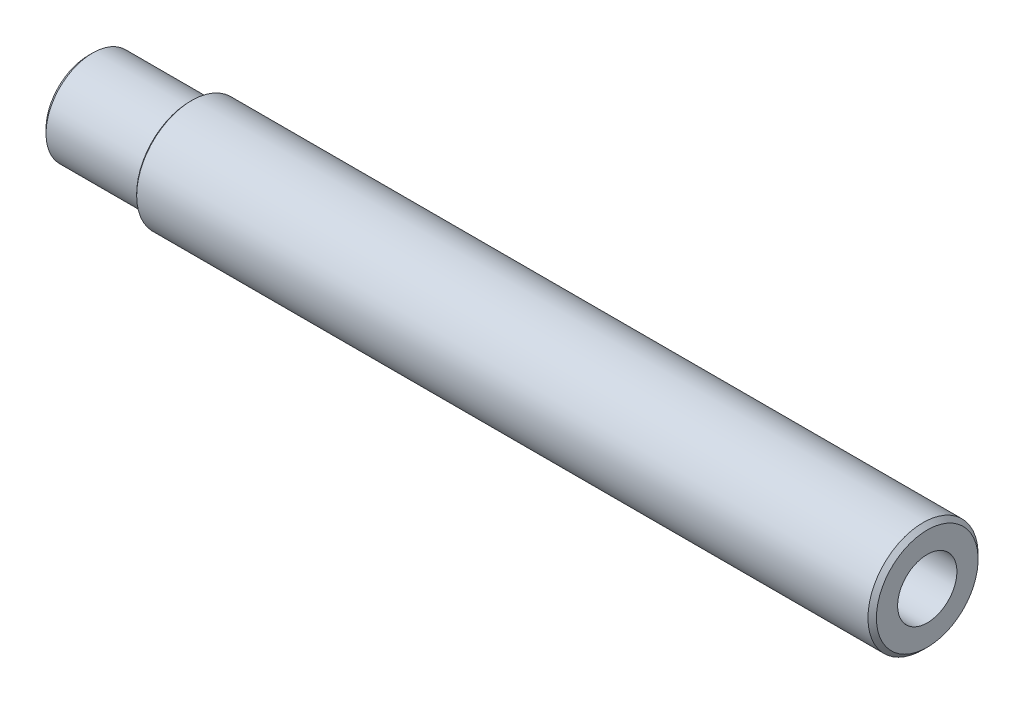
ISO-10303-21;
HEADER;
FILE_DESCRIPTION(('STEP AP214'),'2;1');
FILE_NAME('part.step','',(''),(''),'','','');
FILE_SCHEMA(('AUTOMOTIVE_DESIGN { 1 0 10303 214 1 1 1 1 }'));
ENDSEC;
DATA;
#1=APPLICATION_CONTEXT('core data for automotive mechanical design processes');
#2=APPLICATION_PROTOCOL_DEFINITION('international standard','automotive_design',2000,#1);
#3=PRODUCT_CONTEXT('',#1,'mechanical');
#4=PRODUCT('Part','Part','',(#3));
#5=PRODUCT_RELATED_PRODUCT_CATEGORY('part','',(#4));
#6=PRODUCT_DEFINITION_FORMATION('','',#4);
#7=PRODUCT_DEFINITION_CONTEXT('part definition',#1,'design');
#8=PRODUCT_DEFINITION('design','',#6,#7);
#9=PRODUCT_DEFINITION_SHAPE('','',#8);
#10=(LENGTH_UNIT() NAMED_UNIT(*) SI_UNIT(.MILLI.,.METRE.));
#11=(NAMED_UNIT(*) PLANE_ANGLE_UNIT() SI_UNIT($,.RADIAN.));
#12=(NAMED_UNIT(*) SI_UNIT($,.STERADIAN.) SOLID_ANGLE_UNIT());
#13=UNCERTAINTY_MEASURE_WITH_UNIT(LENGTH_MEASURE(1.E-05),#10,'distance_accuracy_value','');
#14=(GEOMETRIC_REPRESENTATION_CONTEXT(3) GLOBAL_UNCERTAINTY_ASSIGNED_CONTEXT((#13)) GLOBAL_UNIT_ASSIGNED_CONTEXT((#10,
#11,#12)) REPRESENTATION_CONTEXT('',''));
#15=CARTESIAN_POINT('',(0.,0.,0.));
#16=DIRECTION('',(0.,0.,1.));
#17=DIRECTION('',(1.,0.,0.));
#18=AXIS2_PLACEMENT_3D('',#15,#16,#17);
#19=CARTESIAN_POINT('',(87.,6.,0.));
#20=DIRECTION('',(-1.,0.,0.));
#21=DIRECTION('',(0.,0.,1.));
#22=AXIS2_PLACEMENT_3D('',#19,#20,#21);
#23=PLANE('',#22);
#24=CARTESIAN_POINT('',(87.,0.,0.));
#25=DIRECTION('',(-1.,0.,0.));
#26=DIRECTION('',(0.,0.,1.));
#27=AXIS2_PLACEMENT_3D('',#24,#25,#26);
#28=CIRCLE('',#27,6.);
#29=CARTESIAN_POINT('',(87.,0.,6.));
#30=VERTEX_POINT('',#29);
#31=EDGE_CURVE('E10',#30,#30,#28,.T.);
#32=ORIENTED_EDGE('',*,*,#31,.F.);
#33=EDGE_LOOP('',(#32));
#34=FACE_BOUND('',#33,.T.);
#35=CARTESIAN_POINT('',(87.,0.,0.));
#36=DIRECTION('',(-1.,0.,0.));
#37=DIRECTION('',(0.,0.,1.));
#38=AXIS2_PLACEMENT_3D('',#35,#36,#37);
#39=CIRCLE('',#38,3.5);
#40=CARTESIAN_POINT('',(87.,0.,3.5));
#41=VERTEX_POINT('',#40);
#42=EDGE_CURVE('E83',#41,#41,#39,.T.);
#43=ORIENTED_EDGE('',*,*,#42,.T.);
#44=EDGE_LOOP('',(#43));
#45=FACE_BOUND('',#44,.T.);
#46=ADVANCED_FACE('F39',(#34,#45),#23,.F.);
#47=CARTESIAN_POINT('',(-12.,0.,0.));
#48=DIRECTION('',(1.,0.,0.));
#49=DIRECTION('',(0.,0.,-1.));
#50=AXIS2_PLACEMENT_3D('',#47,#48,#49);
#51=PLANE('',#50);
#52=CARTESIAN_POINT('',(-12.,0.,0.));
#53=DIRECTION('',(-1.,0.,0.));
#54=DIRECTION('',(0.,0.,1.));
#55=AXIS2_PLACEMENT_3D('',#52,#53,#54);
#56=CIRCLE('',#55,5.);
#57=CARTESIAN_POINT('',(-12.,0.,5.));
#58=VERTEX_POINT('',#57);
#59=EDGE_CURVE('E76',#58,#58,#56,.T.);
#60=ORIENTED_EDGE('',*,*,#59,.T.);
#61=EDGE_LOOP('',(#60));
#62=FACE_BOUND('',#61,.T.);
#63=CARTESIAN_POINT('',(-12.,0.,0.));
#64=DIRECTION('',(-1.,0.,0.));
#65=DIRECTION('',(0.,0.,1.));
#66=AXIS2_PLACEMENT_3D('',#63,#64,#65);
#67=CIRCLE('',#66,3.5);
#68=CARTESIAN_POINT('',(-12.,0.,3.5));
#69=VERTEX_POINT('',#68);
#70=EDGE_CURVE('E80',#69,#69,#67,.T.);
#71=ORIENTED_EDGE('',*,*,#70,.F.);
#72=EDGE_LOOP('',(#71));
#73=FACE_BOUND('',#72,.T.);
#74=ADVANCED_FACE('F101',(#62,#73),#51,.F.);
#75=CARTESIAN_POINT('',(87.,0.,0.));
#76=DIRECTION('',(-1.,0.,0.));
#77=DIRECTION('',(0.,0.,1.));
#78=AXIS2_PLACEMENT_3D('',#75,#76,#77);
#79=CONICAL_SURFACE('',#78,6.,0.785398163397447);
#80=CARTESIAN_POINT('',(86.5,0.,0.));
#81=DIRECTION('',(-1.,0.,0.));
#82=DIRECTION('',(0.,0.,1.));
#83=AXIS2_PLACEMENT_3D('',#80,#81,#82);
#84=CIRCLE('',#83,6.5);
#85=CARTESIAN_POINT('',(86.5,0.,6.5));
#86=VERTEX_POINT('',#85);
#87=EDGE_CURVE('E46',#86,#86,#84,.T.);
#88=ORIENTED_EDGE('',*,*,#87,.F.);
#89=EDGE_LOOP('',(#88));
#90=FACE_BOUND('',#89,.T.);
#91=ORIENTED_EDGE('',*,*,#31,.T.);
#92=EDGE_LOOP('',(#91));
#93=FACE_BOUND('',#92,.T.);
#94=ADVANCED_FACE('F106',(#90,#93),#79,.T.);
#95=CARTESIAN_POINT('',(87.,0.,0.));
#96=DIRECTION('',(-1.,0.,0.));
#97=DIRECTION('',(0.,0.,1.));
#98=AXIS2_PLACEMENT_3D('',#95,#96,#97);
#99=CYLINDRICAL_SURFACE('',#98,6.5);
#100=CARTESIAN_POINT('',(0.200000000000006,0.,0.));
#101=DIRECTION('',(-1.,0.,0.));
#102=DIRECTION('',(0.,0.,1.));
#103=AXIS2_PLACEMENT_3D('',#100,#101,#102);
#104=CIRCLE('',#103,6.5);
#105=CARTESIAN_POINT('',(0.200000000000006,0.,6.5));
#106=VERTEX_POINT('',#105);
#107=EDGE_CURVE('E52',#106,#106,#104,.T.);
#108=ORIENTED_EDGE('',*,*,#107,.F.);
#109=EDGE_LOOP('',(#108));
#110=FACE_BOUND('',#109,.T.);
#111=ORIENTED_EDGE('',*,*,#87,.T.);
#112=EDGE_LOOP('',(#111));
#113=FACE_BOUND('',#112,.T.);
#114=ADVANCED_FACE('F111',(#110,#113),#99,.T.);
#115=CARTESIAN_POINT('',(0.200000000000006,0.,0.));
#116=DIRECTION('',(1.,0.,0.));
#117=DIRECTION('',(0.,0.,-1.));
#118=AXIS2_PLACEMENT_3D('',#115,#116,#117);
#119=CONICAL_SURFACE('',#118,6.5,0.785398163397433);
#120=CARTESIAN_POINT('',(0.,0.,0.));
#121=DIRECTION('',(-1.,0.,0.));
#122=DIRECTION('',(0.,0.,1.));
#123=AXIS2_PLACEMENT_3D('',#120,#121,#122);
#124=CIRCLE('',#123,6.3);
#125=CARTESIAN_POINT('',(0.,0.,6.3));
#126=VERTEX_POINT('',#125);
#127=EDGE_CURVE('E58',#126,#126,#124,.T.);
#128=ORIENTED_EDGE('',*,*,#127,.F.);
#129=EDGE_LOOP('',(#128));
#130=FACE_BOUND('',#129,.T.);
#131=ORIENTED_EDGE('',*,*,#107,.T.);
#132=EDGE_LOOP('',(#131));
#133=FACE_BOUND('',#132,.T.);
#134=ADVANCED_FACE('F125',(#130,#133),#119,.T.);
#135=CARTESIAN_POINT('',(0.,5.8,0.));
#136=DIRECTION('',(1.,0.,0.));
#137=DIRECTION('',(0.,0.,-1.));
#138=AXIS2_PLACEMENT_3D('',#135,#136,#137);
#139=PLANE('',#138);
#140=CARTESIAN_POINT('',(0.,0.,0.));
#141=DIRECTION('',(-1.,0.,0.));
#142=DIRECTION('',(0.,0.,1.));
#143=AXIS2_PLACEMENT_3D('',#140,#141,#142);
#144=CIRCLE('',#143,5.8);
#145=CARTESIAN_POINT('',(0.,0.,5.8));
#146=VERTEX_POINT('',#145);
#147=EDGE_CURVE('E64',#146,#146,#144,.T.);
#148=ORIENTED_EDGE('',*,*,#147,.F.);
#149=EDGE_LOOP('',(#148));
#150=FACE_BOUND('',#149,.T.);
#151=ORIENTED_EDGE('',*,*,#127,.T.);
#152=EDGE_LOOP('',(#151));
#153=FACE_BOUND('',#152,.T.);
#154=ADVANCED_FACE('F121',(#150,#153),#139,.F.);
#155=CARTESIAN_POINT('',(-0.299999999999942,0.,0.));
#156=DIRECTION('',(-1.,0.,0.));
#157=DIRECTION('',(0.,0.,1.));
#158=AXIS2_PLACEMENT_3D('',#155,#156,#157);
#159=TOROIDAL_SURFACE('',#158,5.79999999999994,0.299999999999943);
#160=CARTESIAN_POINT('',(-0.299999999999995,0.,0.));
#161=DIRECTION('',(-1.,0.,0.));
#162=DIRECTION('',(0.,0.,1.));
#163=AXIS2_PLACEMENT_3D('',#160,#161,#162);
#164=CIRCLE('',#163,5.5);
#165=CARTESIAN_POINT('',(-0.299999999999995,0.,5.5));
#166=VERTEX_POINT('',#165);
#167=EDGE_CURVE('E68',#166,#166,#164,.T.);
#168=ORIENTED_EDGE('',*,*,#167,.F.);
#169=EDGE_LOOP('',(#168));
#170=FACE_BOUND('',#169,.T.);
#171=ORIENTED_EDGE('',*,*,#147,.T.);
#172=EDGE_LOOP('',(#171));
#173=FACE_BOUND('',#172,.T.);
#174=ADVANCED_FACE('F117',(#170,#173),#159,.F.);
#175=CARTESIAN_POINT('',(87.,0.,0.));
#176=DIRECTION('',(-1.,0.,0.));
#177=DIRECTION('',(0.,0.,1.));
#178=AXIS2_PLACEMENT_3D('',#175,#176,#177);
#179=CYLINDRICAL_SURFACE('',#178,5.5);
#180=CARTESIAN_POINT('',(-11.5,0.,0.));
#181=DIRECTION('',(-1.,0.,0.));
#182=DIRECTION('',(0.,0.,1.));
#183=AXIS2_PLACEMENT_3D('',#180,#181,#182);
#184=CIRCLE('',#183,5.5);
#185=CARTESIAN_POINT('',(-11.5,0.,5.5));
#186=VERTEX_POINT('',#185);
#187=EDGE_CURVE('E72',#186,#186,#184,.T.);
#188=ORIENTED_EDGE('',*,*,#187,.F.);
#189=EDGE_LOOP('',(#188));
#190=FACE_BOUND('',#189,.T.);
#191=ORIENTED_EDGE('',*,*,#167,.T.);
#192=EDGE_LOOP('',(#191));
#193=FACE_BOUND('',#192,.T.);
#194=ADVANCED_FACE('F96',(#190,#193),#179,.T.);
#195=CARTESIAN_POINT('',(-11.5,0.,0.));
#196=DIRECTION('',(1.,0.,0.));
#197=DIRECTION('',(0.,0.,-1.));
#198=AXIS2_PLACEMENT_3D('',#195,#196,#197);
#199=CONICAL_SURFACE('',#198,5.5,0.785398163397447);
#200=ORIENTED_EDGE('',*,*,#59,.F.);
#201=EDGE_LOOP('',(#200));
#202=FACE_BOUND('',#201,.T.);
#203=ORIENTED_EDGE('',*,*,#187,.T.);
#204=EDGE_LOOP('',(#203));
#205=FACE_BOUND('',#204,.T.);
#206=ADVANCED_FACE('F90',(#202,#205),#199,.T.);
#207=CARTESIAN_POINT('',(87.,0.,0.));
#208=DIRECTION('',(-1.,0.,0.));
#209=DIRECTION('',(0.,0.,1.));
#210=AXIS2_PLACEMENT_3D('',#207,#208,#209);
#211=CYLINDRICAL_SURFACE('',#210,3.5);
#212=ORIENTED_EDGE('',*,*,#70,.T.);
#213=EDGE_LOOP('',(#212));
#214=FACE_BOUND('',#213,.T.);
#215=ORIENTED_EDGE('',*,*,#42,.F.);
#216=EDGE_LOOP('',(#215));
#217=FACE_BOUND('',#216,.T.);
#218=ADVANCED_FACE('F88',(#214,#217),#211,.F.);
#219=CLOSED_SHELL('',(#46,#74,#94,#114,#134,#154,#174,#194,#206,#218));
#220=MANIFOLD_SOLID_BREP('B2',#219);
#221=ADVANCED_BREP_SHAPE_REPRESENTATION('',(#18,#220),#14);
#222=SHAPE_DEFINITION_REPRESENTATION(#9,#221);
ENDSEC;
END-ISO-10303-21;
